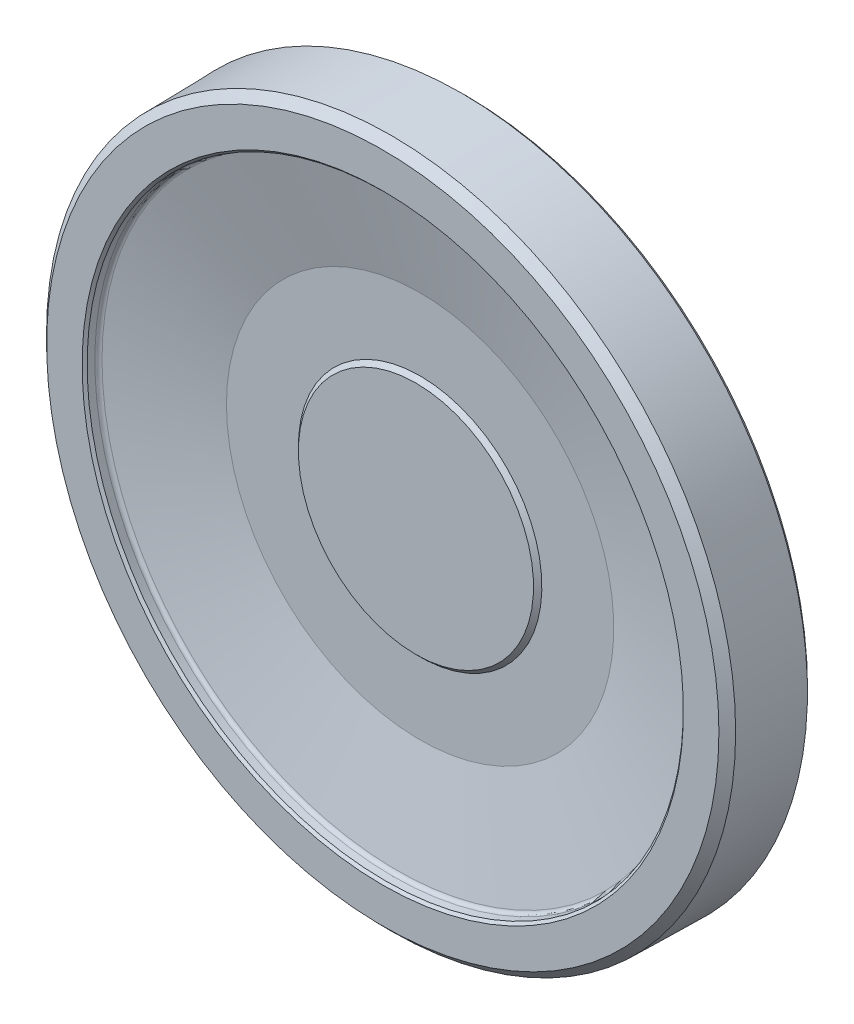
ISO-10303-21;
HEADER;
FILE_DESCRIPTION(('STEP AP214'),'2;1');
FILE_NAME('part.step','',(''),(''),'','','');
FILE_SCHEMA(('AUTOMOTIVE_DESIGN { 1 0 10303 214 1 1 1 1 }'));
ENDSEC;
DATA;
#1=APPLICATION_CONTEXT('core data for automotive mechanical design processes');
#2=APPLICATION_PROTOCOL_DEFINITION('international standard','automotive_design',2000,#1);
#3=PRODUCT_CONTEXT('',#1,'mechanical');
#4=PRODUCT('Part','Part','',(#3));
#5=PRODUCT_RELATED_PRODUCT_CATEGORY('part','',(#4));
#6=PRODUCT_DEFINITION_FORMATION('','',#4);
#7=PRODUCT_DEFINITION_CONTEXT('part definition',#1,'design');
#8=PRODUCT_DEFINITION('design','',#6,#7);
#9=PRODUCT_DEFINITION_SHAPE('','',#8);
#10=(LENGTH_UNIT() NAMED_UNIT(*) SI_UNIT(.MILLI.,.METRE.));
#11=(NAMED_UNIT(*) PLANE_ANGLE_UNIT() SI_UNIT($,.RADIAN.));
#12=(NAMED_UNIT(*) SI_UNIT($,.STERADIAN.) SOLID_ANGLE_UNIT());
#13=UNCERTAINTY_MEASURE_WITH_UNIT(LENGTH_MEASURE(1.E-05),#10,'distance_accuracy_value','');
#14=(GEOMETRIC_REPRESENTATION_CONTEXT(3) GLOBAL_UNCERTAINTY_ASSIGNED_CONTEXT((#13)) GLOBAL_UNIT_ASSIGNED_CONTEXT((#10,
#11,#12)) REPRESENTATION_CONTEXT('',''));
#15=CARTESIAN_POINT('',(0.,0.,0.));
#16=DIRECTION('',(0.,0.,1.));
#17=DIRECTION('',(1.,0.,0.));
#18=AXIS2_PLACEMENT_3D('',#15,#16,#17);
#19=CARTESIAN_POINT('',(0.,0.,38.));
#20=DIRECTION('',(0.,0.,-1.));
#21=DIRECTION('',(0.,1.,0.));
#22=AXIS2_PLACEMENT_3D('',#19,#20,#21);
#23=PLANE('',#22);
#24=CARTESIAN_POINT('',(0.,0.,38.));
#25=DIRECTION('',(0.,0.,-1.));
#26=DIRECTION('',(0.,1.,0.));
#27=AXIS2_PLACEMENT_3D('',#24,#25,#26);
#28=CIRCLE('',#27,21.25);
#29=CARTESIAN_POINT('',(0.,21.25,38.));
#30=VERTEX_POINT('',#29);
#31=EDGE_CURVE('E15',#30,#30,#28,.T.);
#32=ORIENTED_EDGE('',*,*,#31,.F.);
#33=EDGE_LOOP('',(#32));
#34=FACE_BOUND('',#33,.T.);
#35=ADVANCED_FACE('F12',(#34),#23,.F.);
#36=CARTESIAN_POINT('',(0.,0.,37.25));
#37=DIRECTION('',(0.,0.,-1.));
#38=DIRECTION('',(0.,1.,0.));
#39=AXIS2_PLACEMENT_3D('',#36,#37,#38);
#40=CONICAL_SURFACE('',#39,22.,0.785398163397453);
#41=ORIENTED_EDGE('',*,*,#31,.T.);
#42=EDGE_LOOP('',(#41));
#43=FACE_BOUND('',#42,.T.);
#44=CARTESIAN_POINT('',(0.,0.,37.25));
#45=DIRECTION('',(0.,0.,-1.));
#46=DIRECTION('',(0.,1.,0.));
#47=AXIS2_PLACEMENT_3D('',#44,#45,#46);
#48=CIRCLE('',#47,22.);
#49=CARTESIAN_POINT('',(0.,22.,37.25));
#50=VERTEX_POINT('',#49);
#51=EDGE_CURVE('E148',#50,#50,#48,.F.);
#52=ORIENTED_EDGE('',*,*,#51,.T.);
#53=EDGE_LOOP('',(#52));
#54=FACE_BOUND('',#53,.T.);
#55=ADVANCED_FACE('F103',(#43,#54),#40,.T.);
#56=CARTESIAN_POINT('',(22.,0.,37.25));
#57=DIRECTION('',(0.,0.,-1.));
#58=DIRECTION('',(0.,1.,0.));
#59=AXIS2_PLACEMENT_3D('',#56,#57,#58);
#60=PLANE('',#59);
#61=ORIENTED_EDGE('',*,*,#51,.F.);
#62=EDGE_LOOP('',(#61));
#63=FACE_BOUND('',#62,.T.);
#64=CARTESIAN_POINT('',(0.,0.,37.25));
#65=DIRECTION('',(0.,0.,1.));
#66=DIRECTION('',(-1.,0.,0.));
#67=AXIS2_PLACEMENT_3D('',#64,#65,#66);
#68=CIRCLE('',#67,35.);
#69=CARTESIAN_POINT('',(-35.,0.,37.25));
#70=VERTEX_POINT('',#69);
#71=EDGE_CURVE('E146',#70,#70,#68,.T.);
#72=ORIENTED_EDGE('',*,*,#71,.T.);
#73=EDGE_LOOP('',(#72));
#74=FACE_BOUND('',#73,.T.);
#75=ADVANCED_FACE('F100',(#63,#74),#60,.F.);
#76=CARTESIAN_POINT('',(0.,0.,41.4691641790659));
#77=DIRECTION('',(0.,0.,1.));
#78=DIRECTION('',(-1.,0.,0.));
#79=AXIS2_PLACEMENT_3D('',#76,#77,#78);
#80=CONICAL_SURFACE('',#79,53.2752078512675,1.34390352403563);
#81=ORIENTED_EDGE('',*,*,#71,.F.);
#82=EDGE_LOOP('',(#81));
#83=FACE_BOUND('',#82,.T.);
#84=CARTESIAN_POINT('',(0.,0.,41.4691641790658));
#85=DIRECTION('',(0.,0.,-1.));
#86=DIRECTION('',(0.,1.,0.));
#87=AXIS2_PLACEMENT_3D('',#84,#85,#86);
#88=CIRCLE('',#87,53.2752078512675);
#89=CARTESIAN_POINT('',(0.,53.2752078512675,41.4691641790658));
#90=VERTEX_POINT('',#89);
#91=EDGE_CURVE('E83',#90,#90,#88,.F.);
#92=ORIENTED_EDGE('',*,*,#91,.T.);
#93=EDGE_LOOP('',(#92));
#94=FACE_BOUND('',#93,.T.);
#95=ADVANCED_FACE('F95',(#83,#94),#80,.F.);
#96=CARTESIAN_POINT('',(0.,0.,42.1999417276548));
#97=DIRECTION('',(0.,0.,-1.));
#98=DIRECTION('',(0.,1.,0.));
#99=AXIS2_PLACEMENT_3D('',#96,#97,#98);
#100=TOROIDAL_SURFACE('',#99,53.1064945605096,0.750000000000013);
#101=ORIENTED_EDGE('',*,*,#91,.F.);
#102=EDGE_LOOP('',(#101));
#103=FACE_BOUND('',#102,.T.);
#104=CARTESIAN_POINT('',(0.,0.,42.1868524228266));
#105=DIRECTION('',(0.,0.,1.));
#106=DIRECTION('',(0.,-1.,0.));
#107=AXIS2_PLACEMENT_3D('',#104,#105,#106);
#108=CIRCLE('',#107,53.8563803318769);
#109=CARTESIAN_POINT('',(0.,-53.8563803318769,42.1868524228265));
#110=VERTEX_POINT('',#109);
#111=EDGE_CURVE('E78',#110,#110,#108,.T.);
#112=ORIENTED_EDGE('',*,*,#111,.T.);
#113=EDGE_LOOP('',(#112));
#114=FACE_BOUND('',#113,.T.);
#115=ADVANCED_FACE('F90',(#103,#114),#100,.F.);
#116=CARTESIAN_POINT('',(0.,0.,43.5500685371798));
#117=DIRECTION('',(0.,0.,1.));
#118=DIRECTION('',(0.,-1.,0.));
#119=AXIS2_PLACEMENT_3D('',#116,#117,#118);
#120=CONICAL_SURFACE('',#119,53.8801753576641,0.0174532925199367);
#121=ORIENTED_EDGE('',*,*,#111,.F.);
#122=EDGE_LOOP('',(#121));
#123=FACE_BOUND('',#122,.T.);
#124=CARTESIAN_POINT('',(0.,0.,43.5500685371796));
#125=DIRECTION('',(0.,0.,1.));
#126=DIRECTION('',(0.,-1.,0.));
#127=AXIS2_PLACEMENT_3D('',#124,#125,#126);
#128=CIRCLE('',#127,53.8801753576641);
#129=CARTESIAN_POINT('',(0.,-53.8801753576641,43.5500685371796));
#130=VERTEX_POINT('',#129);
#131=EDGE_CURVE('E74',#130,#130,#128,.T.);
#132=ORIENTED_EDGE('',*,*,#131,.T.);
#133=EDGE_LOOP('',(#132));
#134=FACE_BOUND('',#133,.T.);
#135=ADVANCED_FACE('F94',(#123,#134),#120,.F.);
#136=CARTESIAN_POINT('',(0.,0.,44.));
#137=DIRECTION('',(0.,0.,1.));
#138=DIRECTION('',(0.,-1.,0.));
#139=AXIS2_PLACEMENT_3D('',#136,#137,#138);
#140=CONICAL_SURFACE('',#139,54.3380289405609,0.794124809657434);
#141=ORIENTED_EDGE('',*,*,#131,.F.);
#142=EDGE_LOOP('',(#141));
#143=FACE_BOUND('',#142,.T.);
#144=CARTESIAN_POINT('',(0.,0.,44.));
#145=DIRECTION('',(0.,0.,1.));
#146=DIRECTION('',(0.,-1.,0.));
#147=AXIS2_PLACEMENT_3D('',#144,#145,#146);
#148=CIRCLE('',#147,54.3380289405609);
#149=CARTESIAN_POINT('',(0.,-54.3380289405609,44.));
#150=VERTEX_POINT('',#149);
#151=EDGE_CURVE('E77',#150,#150,#148,.T.);
#152=ORIENTED_EDGE('',*,*,#151,.T.);
#153=EDGE_LOOP('',(#152));
#154=FACE_BOUND('',#153,.T.);
#155=ADVANCED_FACE('F162',(#143,#154),#140,.F.);
#156=CARTESIAN_POINT('',(54.3380289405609,0.,44.));
#157=DIRECTION('',(0.,0.,-1.));
#158=DIRECTION('',(0.,1.,0.));
#159=AXIS2_PLACEMENT_3D('',#156,#157,#158);
#160=PLANE('',#159);
#161=ORIENTED_EDGE('',*,*,#151,.F.);
#162=EDGE_LOOP('',(#161));
#163=FACE_BOUND('',#162,.T.);
#164=CARTESIAN_POINT('',(0.,0.,44.));
#165=DIRECTION('',(0.,0.,-1.));
#166=DIRECTION('',(1.,0.,0.));
#167=AXIS2_PLACEMENT_3D('',#164,#165,#166);
#168=CIRCLE('',#167,60.7512653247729);
#169=CARTESIAN_POINT('',(60.7512653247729,0.,44.));
#170=VERTEX_POINT('',#169);
#171=EDGE_CURVE('E141',#170,#170,#168,.T.);
#172=ORIENTED_EDGE('',*,*,#171,.F.);
#173=EDGE_LOOP('',(#172));
#174=FACE_BOUND('',#173,.T.);
#175=ADVANCED_FACE('F167',(#163,#174),#160,.F.);
#176=CARTESIAN_POINT('',(15.25,0.,0.));
#177=DIRECTION('',(0.,0.,1.));
#178=DIRECTION('',(0.,-1.,0.));
#179=AXIS2_PLACEMENT_3D('',#176,#177,#178);
#180=PLANE('',#179);
#181=CARTESIAN_POINT('',(0.,0.,0.));
#182=DIRECTION('',(0.,0.,1.));
#183=DIRECTION('',(-1.,0.,0.));
#184=AXIS2_PLACEMENT_3D('',#181,#182,#183);
#185=CIRCLE('',#184,15.25);
#186=CARTESIAN_POINT('',(-15.25,0.,0.));
#187=VERTEX_POINT('',#186);
#188=EDGE_CURVE('E71',#187,#187,#185,.T.);
#189=ORIENTED_EDGE('',*,*,#188,.F.);
#190=EDGE_LOOP('',(#189));
#191=FACE_BOUND('',#190,.T.);
#192=ADVANCED_FACE('F172',(#191),#180,.F.);
#193=CARTESIAN_POINT('',(0.,0.,42.5002284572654));
#194=DIRECTION('',(0.,0.,-1.));
#195=DIRECTION('',(1.,0.,0.));
#196=AXIS2_PLACEMENT_3D('',#193,#194,#195);
#197=CONICAL_SURFACE('',#196,62.2774439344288,0.794124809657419);
#198=ORIENTED_EDGE('',*,*,#171,.T.);
#199=EDGE_LOOP('',(#198));
#200=FACE_BOUND('',#199,.T.);
#201=CARTESIAN_POINT('',(0.,0.,42.5002284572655));
#202=DIRECTION('',(0.,0.,-1.));
#203=DIRECTION('',(0.,1.,0.));
#204=AXIS2_PLACEMENT_3D('',#201,#202,#203);
#205=CIRCLE('',#204,62.2774439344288);
#206=CARTESIAN_POINT('',(0.,62.2774439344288,42.5002284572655));
#207=VERTEX_POINT('',#206);
#208=EDGE_CURVE('E66',#207,#207,#205,.T.);
#209=ORIENTED_EDGE('',*,*,#208,.F.);
#210=EDGE_LOOP('',(#209));
#211=FACE_BOUND('',#210,.T.);
#212=ADVANCED_FACE('F176',(#200,#211),#197,.T.);
#213=CARTESIAN_POINT('',(0.,0.,0.75));
#214=DIRECTION('',(0.,0.,1.));
#215=DIRECTION('',(-1.,0.,0.));
#216=AXIS2_PLACEMENT_3D('',#213,#214,#215);
#217=CONICAL_SURFACE('',#216,16.,0.785398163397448);
#218=CARTESIAN_POINT('',(0.,0.,0.75));
#219=DIRECTION('',(0.,0.,1.));
#220=DIRECTION('',(0.,-1.,0.));
#221=AXIS2_PLACEMENT_3D('',#218,#219,#220);
#222=CIRCLE('',#221,16.);
#223=CARTESIAN_POINT('',(0.,-16.,0.75));
#224=VERTEX_POINT('',#223);
#225=EDGE_CURVE('E61',#224,#224,#222,.T.);
#226=ORIENTED_EDGE('',*,*,#225,.F.);
#227=EDGE_LOOP('',(#226));
#228=FACE_BOUND('',#227,.T.);
#229=ORIENTED_EDGE('',*,*,#188,.T.);
#230=EDGE_LOOP('',(#229));
#231=FACE_BOUND('',#230,.T.);
#232=ADVANCED_FACE('F179',(#228,#231),#217,.T.);
#233=CARTESIAN_POINT('',(0.,0.,29.7498857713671));
#234=DIRECTION('',(0.,0.,-1.));
#235=DIRECTION('',(0.,1.,0.));
#236=AXIS2_PLACEMENT_3D('',#233,#234,#235);
#237=CONICAL_SURFACE('',#236,62.5000019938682,0.017453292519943);
#238=ORIENTED_EDGE('',*,*,#208,.T.);
#239=EDGE_LOOP('',(#238));
#240=FACE_BOUND('',#239,.T.);
#241=CARTESIAN_POINT('',(0.,0.,29.7498857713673));
#242=DIRECTION('',(0.,0.,1.));
#243=DIRECTION('',(0.,-1.,0.));
#244=AXIS2_PLACEMENT_3D('',#241,#242,#243);
#245=CIRCLE('',#244,62.5000019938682);
#246=CARTESIAN_POINT('',(0.,-62.5000019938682,29.7498857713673));
#247=VERTEX_POINT('',#246);
#248=EDGE_CURVE('E57',#247,#247,#245,.F.);
#249=ORIENTED_EDGE('',*,*,#248,.F.);
#250=EDGE_LOOP('',(#249));
#251=FACE_BOUND('',#250,.T.);
#252=ADVANCED_FACE('F183',(#240,#251),#237,.T.);
#253=CARTESIAN_POINT('',(0.,0.,0.));
#254=DIRECTION('',(0.,0.,1.));
#255=DIRECTION('',(0.,-1.,0.));
#256=AXIS2_PLACEMENT_3D('',#253,#254,#255);
#257=CYLINDRICAL_SURFACE('',#256,16.);
#258=CARTESIAN_POINT('',(0.,0.,15.));
#259=DIRECTION('',(0.,0.,1.));
#260=DIRECTION('',(0.,-1.,0.));
#261=AXIS2_PLACEMENT_3D('',#258,#259,#260);
#262=CIRCLE('',#261,16.);
#263=CARTESIAN_POINT('',(0.,-16.,15.));
#264=VERTEX_POINT('',#263);
#265=EDGE_CURVE('E60',#264,#264,#262,.F.);
#266=ORIENTED_EDGE('',*,*,#265,.T.);
#267=EDGE_LOOP('',(#266));
#268=FACE_BOUND('',#267,.T.);
#269=ORIENTED_EDGE('',*,*,#225,.T.);
#270=EDGE_LOOP('',(#269));
#271=FACE_BOUND('',#270,.T.);
#272=ADVANCED_FACE('F186',(#268,#271),#257,.T.);
#273=CARTESIAN_POINT('',(0.,0.,29.7498857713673));
#274=DIRECTION('',(0.,0.,1.));
#275=DIRECTION('',(0.,-1.,0.));
#276=AXIS2_PLACEMENT_3D('',#273,#274,#275);
#277=CONICAL_SURFACE('',#276,62.5000019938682,0.776671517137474);
#278=ORIENTED_EDGE('',*,*,#248,.T.);
#279=EDGE_LOOP('',(#278));
#280=FACE_BOUND('',#279,.T.);
#281=CARTESIAN_POINT('',(0.,0.,29.));
#282=DIRECTION('',(0.,0.,1.));
#283=DIRECTION('',(0.,-1.,0.));
#284=AXIS2_PLACEMENT_3D('',#281,#282,#283);
#285=CIRCLE('',#284,61.7630912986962);
#286=CARTESIAN_POINT('',(0.,-61.7630912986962,29.));
#287=VERTEX_POINT('',#286);
#288=EDGE_CURVE('E130',#287,#287,#285,.T.);
#289=ORIENTED_EDGE('',*,*,#288,.T.);
#290=EDGE_LOOP('',(#289));
#291=FACE_BOUND('',#290,.T.);
#292=ADVANCED_FACE('F190',(#280,#291),#277,.T.);
#293=CARTESIAN_POINT('',(23.,0.,15.));
#294=DIRECTION('',(0.,0.,1.));
#295=DIRECTION('',(0.,-1.,0.));
#296=AXIS2_PLACEMENT_3D('',#293,#294,#295);
#297=PLANE('',#296);
#298=CARTESIAN_POINT('',(0.,0.,15.));
#299=DIRECTION('',(0.,0.,1.));
#300=DIRECTION('',(0.,-1.,0.));
#301=AXIS2_PLACEMENT_3D('',#298,#299,#300);
#302=CIRCLE('',#301,23.);
#303=CARTESIAN_POINT('',(0.,-23.,15.));
#304=VERTEX_POINT('',#303);
#305=EDGE_CURVE('E128',#304,#304,#302,.T.);
#306=ORIENTED_EDGE('',*,*,#305,.F.);
#307=EDGE_LOOP('',(#306));
#308=FACE_BOUND('',#307,.T.);
#309=ORIENTED_EDGE('',*,*,#265,.F.);
#310=EDGE_LOOP('',(#309));
#311=FACE_BOUND('',#310,.T.);
#312=ADVANCED_FACE('F193',(#308,#311),#297,.F.);
#313=CARTESIAN_POINT('',(61.7630912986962,0.,29.));
#314=DIRECTION('',(0.,0.,1.));
#315=DIRECTION('',(0.,-1.,0.));
#316=AXIS2_PLACEMENT_3D('',#313,#314,#315);
#317=PLANE('',#316);
#318=ORIENTED_EDGE('',*,*,#288,.F.);
#319=EDGE_LOOP('',(#318));
#320=FACE_BOUND('',#319,.T.);
#321=CARTESIAN_POINT('',(0.,0.,29.));
#322=DIRECTION('',(0.,0.,1.));
#323=DIRECTION('',(0.,-1.,0.));
#324=AXIS2_PLACEMENT_3D('',#321,#322,#323);
#325=CIRCLE('',#324,53.8461538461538);
#326=CARTESIAN_POINT('',(0.,-53.8461538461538,29.));
#327=VERTEX_POINT('',#326);
#328=EDGE_CURVE('E54',#327,#327,#325,.T.);
#329=ORIENTED_EDGE('',*,*,#328,.T.);
#330=EDGE_LOOP('',(#329));
#331=FACE_BOUND('',#330,.T.);
#332=ADVANCED_FACE('F125',(#320,#331),#317,.F.);
#333=CARTESIAN_POINT('',(0.,0.,0.));
#334=DIRECTION('',(0.,0.,1.));
#335=DIRECTION('',(0.,-1.,0.));
#336=AXIS2_PLACEMENT_3D('',#333,#334,#335);
#337=CYLINDRICAL_SURFACE('',#336,23.);
#338=CARTESIAN_POINT('',(0.,0.,20.2226068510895));
#339=DIRECTION('',(0.,0.,-1.));
#340=DIRECTION('',(0.,1.,0.));
#341=AXIS2_PLACEMENT_3D('',#338,#339,#340);
#342=CIRCLE('',#341,23.);
#343=CARTESIAN_POINT('',(0.,23.,20.2226068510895));
#344=VERTEX_POINT('',#343);
#345=EDGE_CURVE('E51',#344,#344,#342,.T.);
#346=ORIENTED_EDGE('',*,*,#345,.T.);
#347=EDGE_LOOP('',(#346));
#348=FACE_BOUND('',#347,.T.);
#349=ORIENTED_EDGE('',*,*,#305,.T.);
#350=EDGE_LOOP('',(#349));
#351=FACE_BOUND('',#350,.T.);
#352=ADVANCED_FACE('F122',(#348,#351),#337,.T.);
#353=CARTESIAN_POINT('',(0.,0.,0.));
#354=DIRECTION('',(0.,0.,1.));
#355=DIRECTION('',(0.,-1.,0.));
#356=AXIS2_PLACEMENT_3D('',#353,#354,#355);
#357=CYLINDRICAL_SURFACE('',#356,53.8461538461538);
#358=ORIENTED_EDGE('',*,*,#328,.F.);
#359=EDGE_LOOP('',(#358));
#360=FACE_BOUND('',#359,.T.);
#361=CARTESIAN_POINT('',(0.,0.,31.4288889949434));
#362=DIRECTION('',(0.,0.,-1.));
#363=DIRECTION('',(0.,1.,0.));
#364=AXIS2_PLACEMENT_3D('',#361,#362,#363);
#365=CIRCLE('',#364,53.8461538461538);
#366=CARTESIAN_POINT('',(0.,53.8461538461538,31.4288889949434));
#367=VERTEX_POINT('',#366);
#368=EDGE_CURVE('E24',#367,#367,#365,.F.);
#369=ORIENTED_EDGE('',*,*,#368,.T.);
#370=EDGE_LOOP('',(#369));
#371=FACE_BOUND('',#370,.T.);
#372=ADVANCED_FACE('F45',(#360,#371),#357,.F.);
#373=CARTESIAN_POINT('',(0.,0.,20.2226068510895));
#374=DIRECTION('',(0.,0.,-1.));
#375=DIRECTION('',(0.,1.,0.));
#376=AXIS2_PLACEMENT_3D('',#373,#374,#375);
#377=TOROIDAL_SURFACE('',#376,24.5,1.5);
#378=CARTESIAN_POINT('',(0.,0.,21.6321457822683));
#379=DIRECTION('',(0.,0.,1.));
#380=DIRECTION('',(0.,-1.,0.));
#381=AXIS2_PLACEMENT_3D('',#378,#379,#380);
#382=CIRCLE('',#381,23.9869697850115);
#383=CARTESIAN_POINT('',(0.,-23.9869697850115,21.6321457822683));
#384=VERTEX_POINT('',#383);
#385=EDGE_CURVE('E19',#384,#384,#382,.T.);
#386=ORIENTED_EDGE('',*,*,#385,.F.);
#387=EDGE_LOOP('',(#386));
#388=FACE_BOUND('',#387,.T.);
#389=ORIENTED_EDGE('',*,*,#345,.F.);
#390=EDGE_LOOP('',(#389));
#391=FACE_BOUND('',#390,.T.);
#392=ADVANCED_FACE('F40',(#388,#391),#377,.F.);
#393=CARTESIAN_POINT('',(0.,0.,31.4288889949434));
#394=DIRECTION('',(0.,0.,-1.));
#395=DIRECTION('',(0.,1.,0.));
#396=AXIS2_PLACEMENT_3D('',#393,#394,#395);
#397=TOROIDAL_SURFACE('',#396,53.0961538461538,0.75);
#398=ORIENTED_EDGE('',*,*,#368,.F.);
#399=EDGE_LOOP('',(#398));
#400=FACE_BOUND('',#399,.T.);
#401=CARTESIAN_POINT('',(0.,0.,32.1336584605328));
#402=DIRECTION('',(0.,0.,1.));
#403=DIRECTION('',(0.,-1.,0.));
#404=AXIS2_PLACEMENT_3D('',#401,#402,#403);
#405=CIRCLE('',#404,52.8396387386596);
#406=CARTESIAN_POINT('',(0.,-52.8396387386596,32.1336584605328));
#407=VERTEX_POINT('',#406);
#408=EDGE_CURVE('E8',#407,#407,#405,.F.);
#409=ORIENTED_EDGE('',*,*,#408,.F.);
#410=EDGE_LOOP('',(#409));
#411=FACE_BOUND('',#410,.T.);
#412=ADVANCED_FACE('F35',(#400,#411),#397,.F.);
#413=CARTESIAN_POINT('',(0.,0.,32.1336584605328));
#414=DIRECTION('',(0.,0.,1.));
#415=DIRECTION('',(0.,-1.,0.));
#416=AXIS2_PLACEMENT_3D('',#413,#414,#415);
#417=CONICAL_SURFACE('',#416,52.8396387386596,1.22173047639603);
#418=ORIENTED_EDGE('',*,*,#408,.T.);
#419=EDGE_LOOP('',(#418));
#420=FACE_BOUND('',#419,.T.);
#421=ORIENTED_EDGE('',*,*,#385,.T.);
#422=EDGE_LOOP('',(#421));
#423=FACE_BOUND('',#422,.T.);
#424=ADVANCED_FACE('F39',(#420,#423),#417,.T.);
#425=CLOSED_SHELL('',(#35,#55,#75,#95,#115,#135,#155,#175,#192,#212,#232,#252,#272,#292,#312,
#332,#352,#372,#392,#412,#424));
#426=MANIFOLD_SOLID_BREP('B1',#425);
#427=ADVANCED_BREP_SHAPE_REPRESENTATION('',(#18,#426),#14);
#428=SHAPE_DEFINITION_REPRESENTATION(#9,#427);
ENDSEC;
END-ISO-10303-21;
